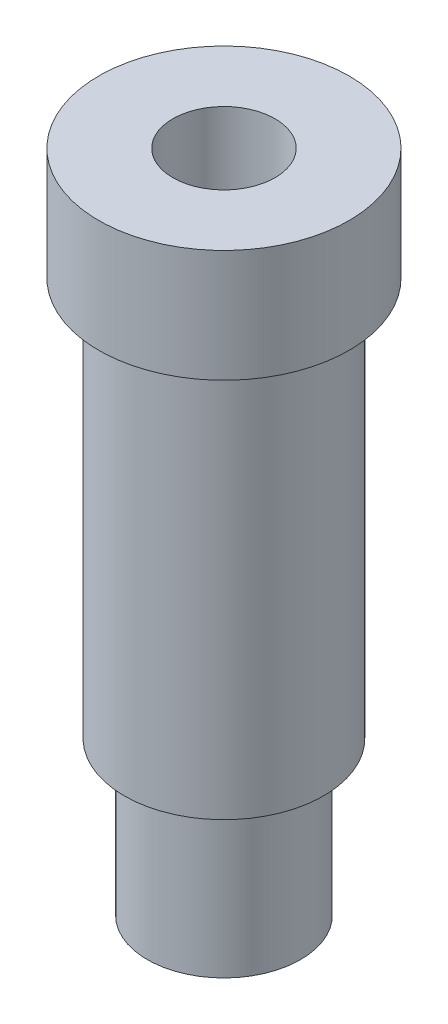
from build123d import *

# Parameters (mm, degrees)
ESQUISSE2_R             = 1
ENL_V_MAT_EXTRU_1_DEPTH = 14.453809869


with BuildPart() as part:
    # Esquisse1 → R_volution2 (revolve)
    with BuildSketch(Plane.XY, mode=Mode.PRIVATE) as r_volution2_sk:
        Polygon((0, 13), (2.45, 13), (2.45, 10.8), (1.95, 10.8), (1.95, 3), (1.5, 3), (1.5, 0), (0, 0), align=None)
    revolve(r_volution2_sk.sketch.rotate(Axis((0, -2.821668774, 0), (0, 1, 0)), 90), axis=Axis((0, -2.821668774, 0), (0, 1, 0)))

    # Esquisse2 → Enl_v. mat.-Extru.1 (cut, through all)
    with BuildSketch(Plane(origin=(0, 13, 0), x_dir=(-1, 0, 0), z_dir=(0, 1, 0))):
        with Locations(Location((0, 0, 0), (0, 0, 90))):
            Circle(ESQUISSE2_R)
    extrude(amount=-ENL_V_MAT_EXTRU_1_DEPTH, mode=Mode.SUBTRACT)


solid = part.part
